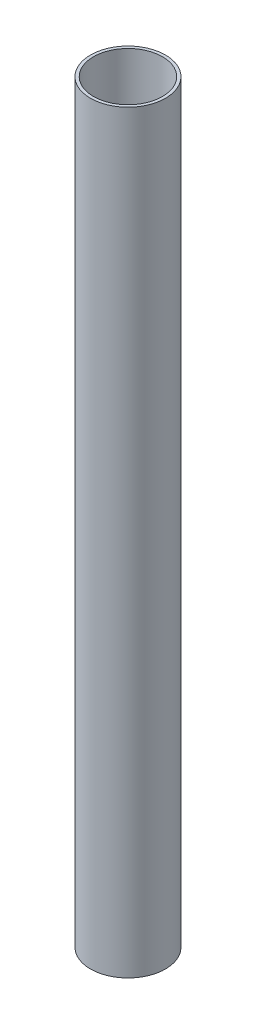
ISO-10303-21;
HEADER;
FILE_DESCRIPTION(('STEP AP214'),'2;1');
FILE_NAME('part.step','',(''),(''),'','','');
FILE_SCHEMA(('AUTOMOTIVE_DESIGN { 1 0 10303 214 1 1 1 1 }'));
ENDSEC;
DATA;
#1=APPLICATION_CONTEXT('core data for automotive mechanical design processes');
#2=APPLICATION_PROTOCOL_DEFINITION('international standard','automotive_design',2000,#1);
#3=PRODUCT_CONTEXT('',#1,'mechanical');
#4=PRODUCT('Part','Part','',(#3));
#5=PRODUCT_RELATED_PRODUCT_CATEGORY('part','',(#4));
#6=PRODUCT_DEFINITION_FORMATION('','',#4);
#7=PRODUCT_DEFINITION_CONTEXT('part definition',#1,'design');
#8=PRODUCT_DEFINITION('design','',#6,#7);
#9=PRODUCT_DEFINITION_SHAPE('','',#8);
#10=(LENGTH_UNIT() NAMED_UNIT(*) SI_UNIT(.MILLI.,.METRE.));
#11=(NAMED_UNIT(*) PLANE_ANGLE_UNIT() SI_UNIT($,.RADIAN.));
#12=(NAMED_UNIT(*) SI_UNIT($,.STERADIAN.) SOLID_ANGLE_UNIT());
#13=UNCERTAINTY_MEASURE_WITH_UNIT(LENGTH_MEASURE(1.E-05),#10,'distance_accuracy_value','');
#14=(GEOMETRIC_REPRESENTATION_CONTEXT(3) GLOBAL_UNCERTAINTY_ASSIGNED_CONTEXT((#13)) GLOBAL_UNIT_ASSIGNED_CONTEXT((#10,
#11,#12)) REPRESENTATION_CONTEXT('',''));
#15=CARTESIAN_POINT('',(0.,0.,0.));
#16=DIRECTION('',(0.,0.,1.));
#17=DIRECTION('',(1.,0.,0.));
#18=AXIS2_PLACEMENT_3D('',#15,#16,#17);
#19=CARTESIAN_POINT('',(0.,111.76,0.));
#20=DIRECTION('',(0.,1.,0.));
#21=DIRECTION('',(0.,0.,1.));
#22=AXIS2_PLACEMENT_3D('',#19,#20,#21);
#23=PLANE('',#22);
#24=CARTESIAN_POINT('',(0.,111.76,0.));
#25=DIRECTION('',(0.,1.,0.));
#26=DIRECTION('',(0.,0.,1.));
#27=AXIS2_PLACEMENT_3D('',#24,#25,#26);
#28=CIRCLE('',#27,11.1125);
#29=CARTESIAN_POINT('',(0.,111.76,11.1125));
#30=VERTEX_POINT('',#29);
#31=EDGE_CURVE('E11',#30,#30,#28,.T.);
#32=ORIENTED_EDGE('',*,*,#31,.T.);
#33=EDGE_LOOP('',(#32));
#34=FACE_BOUND('',#33,.T.);
#35=CARTESIAN_POINT('',(0.,111.76,0.));
#36=DIRECTION('',(0.,1.,0.));
#37=DIRECTION('',(1.,0.,0.));
#38=AXIS2_PLACEMENT_3D('',#35,#36,#37);
#39=CIRCLE('',#38,10.2235);
#40=CARTESIAN_POINT('',(10.2235,111.76,0.));
#41=VERTEX_POINT('',#40);
#42=EDGE_CURVE('E49',#41,#41,#39,.T.);
#43=ORIENTED_EDGE('',*,*,#42,.F.);
#44=EDGE_LOOP('',(#43));
#45=FACE_BOUND('',#44,.T.);
#46=ADVANCED_FACE('F38',(#34,#45),#23,.T.);
#47=CARTESIAN_POINT('',(0.,-111.76,0.));
#48=DIRECTION('',(0.,1.,0.));
#49=DIRECTION('',(0.,0.,1.));
#50=AXIS2_PLACEMENT_3D('',#47,#48,#49);
#51=PLANE('',#50);
#52=CARTESIAN_POINT('',(0.,-111.76,0.));
#53=DIRECTION('',(0.,1.,0.));
#54=DIRECTION('',(0.,0.,1.));
#55=AXIS2_PLACEMENT_3D('',#52,#53,#54);
#56=CIRCLE('',#55,11.1125);
#57=CARTESIAN_POINT('',(0.,-111.76,11.1125));
#58=VERTEX_POINT('',#57);
#59=EDGE_CURVE('E42',#58,#58,#56,.T.);
#60=ORIENTED_EDGE('',*,*,#59,.F.);
#61=EDGE_LOOP('',(#60));
#62=FACE_BOUND('',#61,.T.);
#63=CARTESIAN_POINT('',(0.,-111.76,0.));
#64=DIRECTION('',(0.,1.,0.));
#65=DIRECTION('',(1.,0.,0.));
#66=AXIS2_PLACEMENT_3D('',#63,#64,#65);
#67=CIRCLE('',#66,10.2235);
#68=CARTESIAN_POINT('',(10.2235,-111.76,0.));
#69=VERTEX_POINT('',#68);
#70=EDGE_CURVE('E51',#69,#69,#67,.T.);
#71=ORIENTED_EDGE('',*,*,#70,.T.);
#72=EDGE_LOOP('',(#71));
#73=FACE_BOUND('',#72,.T.);
#74=ADVANCED_FACE('F61',(#62,#73),#51,.F.);
#75=CARTESIAN_POINT('',(0.,111.76,0.));
#76=DIRECTION('',(0.,-1.,0.));
#77=DIRECTION('',(0.,0.,-1.));
#78=AXIS2_PLACEMENT_3D('',#75,#76,#77);
#79=CYLINDRICAL_SURFACE('',#78,11.1125);
#80=ORIENTED_EDGE('',*,*,#31,.F.);
#81=EDGE_LOOP('',(#80));
#82=FACE_BOUND('',#81,.T.);
#83=ORIENTED_EDGE('',*,*,#59,.T.);
#84=EDGE_LOOP('',(#83));
#85=FACE_BOUND('',#84,.T.);
#86=ADVANCED_FACE('F40',(#82,#85),#79,.T.);
#87=CARTESIAN_POINT('',(0.,111.76,0.));
#88=DIRECTION('',(0.,-1.,0.));
#89=DIRECTION('',(0.,0.,-1.));
#90=AXIS2_PLACEMENT_3D('',#87,#88,#89);
#91=CYLINDRICAL_SURFACE('',#90,10.2235);
#92=ORIENTED_EDGE('',*,*,#42,.T.);
#93=EDGE_LOOP('',(#92));
#94=FACE_BOUND('',#93,.T.);
#95=ORIENTED_EDGE('',*,*,#70,.F.);
#96=EDGE_LOOP('',(#95));
#97=FACE_BOUND('',#96,.T.);
#98=ADVANCED_FACE('F57',(#94,#97),#91,.F.);
#99=CLOSED_SHELL('',(#46,#74,#86,#98));
#100=MANIFOLD_SOLID_BREP('B2',#99);
#101=ADVANCED_BREP_SHAPE_REPRESENTATION('',(#18,#100),#14);
#102=SHAPE_DEFINITION_REPRESENTATION(#9,#101);
ENDSEC;
END-ISO-10303-21;
